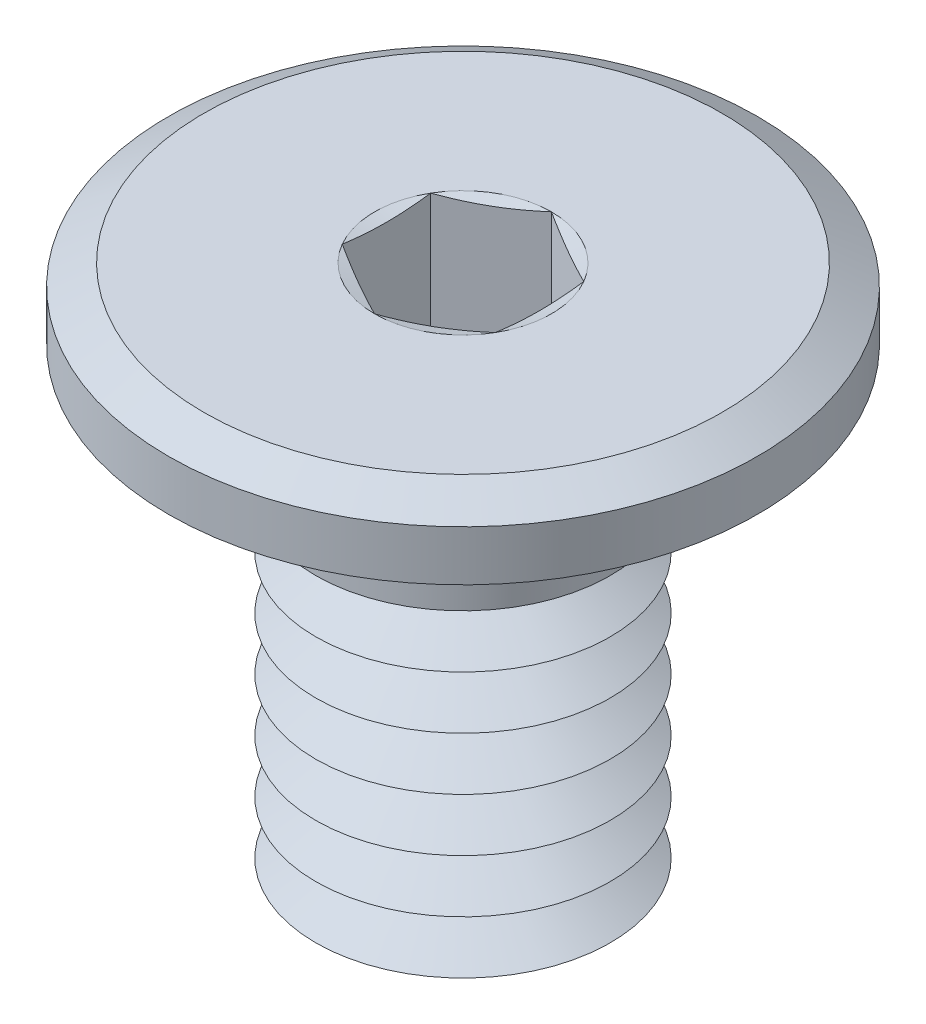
ISO-10303-21;
HEADER;
FILE_DESCRIPTION(('STEP AP214'),'2;1');
FILE_NAME('part.step','',(''),(''),'','','');
FILE_SCHEMA(('AUTOMOTIVE_DESIGN { 1 0 10303 214 1 1 1 1 }'));
ENDSEC;
DATA;
#1=APPLICATION_CONTEXT('core data for automotive mechanical design processes');
#2=APPLICATION_PROTOCOL_DEFINITION('international standard','automotive_design',2000,#1);
#3=PRODUCT_CONTEXT('',#1,'mechanical');
#4=PRODUCT('Part','Part','',(#3));
#5=PRODUCT_RELATED_PRODUCT_CATEGORY('part','',(#4));
#6=PRODUCT_DEFINITION_FORMATION('','',#4);
#7=PRODUCT_DEFINITION_CONTEXT('part definition',#1,'design');
#8=PRODUCT_DEFINITION('design','',#6,#7);
#9=PRODUCT_DEFINITION_SHAPE('','',#8);
#10=(LENGTH_UNIT() NAMED_UNIT(*) SI_UNIT(.MILLI.,.METRE.));
#11=(NAMED_UNIT(*) PLANE_ANGLE_UNIT() SI_UNIT($,.RADIAN.));
#12=(NAMED_UNIT(*) SI_UNIT($,.STERADIAN.) SOLID_ANGLE_UNIT());
#13=UNCERTAINTY_MEASURE_WITH_UNIT(LENGTH_MEASURE(1.E-05),#10,'distance_accuracy_value','');
#14=(GEOMETRIC_REPRESENTATION_CONTEXT(3) GLOBAL_UNCERTAINTY_ASSIGNED_CONTEXT((#13)) GLOBAL_UNIT_ASSIGNED_CONTEXT((#10,
#11,#12)) REPRESENTATION_CONTEXT('',''));
#15=CARTESIAN_POINT('',(0.,0.,0.));
#16=DIRECTION('',(0.,0.,1.));
#17=DIRECTION('',(1.,0.,0.));
#18=AXIS2_PLACEMENT_3D('',#15,#16,#17);
#19=CARTESIAN_POINT('',(0.,-3.925,0.));
#20=DIRECTION('',(0.,-1.,0.));
#21=DIRECTION('',(0.,0.,-1.));
#22=AXIS2_PLACEMENT_3D('',#19,#20,#21);
#23=CONICAL_SURFACE('',#22,1.25,1.0471975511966);
#24=CARTESIAN_POINT('',(0.,-3.7,0.));
#25=DIRECTION('',(0.,1.,0.));
#26=DIRECTION('',(0.,0.,1.));
#27=AXIS2_PLACEMENT_3D('',#24,#25,#26);
#28=CIRCLE('',#27,0.860288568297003);
#29=CARTESIAN_POINT('',(0.,-3.7,0.860288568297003));
#30=VERTEX_POINT('',#29);
#31=EDGE_CURVE('E411',#30,#30,#28,.T.);
#32=ORIENTED_EDGE('',*,*,#31,.F.);
#33=EDGE_LOOP('',(#32));
#34=FACE_BOUND('',#33,.T.);
#35=CARTESIAN_POINT('',(0.,-3.925,0.));
#36=DIRECTION('',(0.,1.,0.));
#37=DIRECTION('',(0.,0.,1.));
#38=AXIS2_PLACEMENT_3D('',#35,#36,#37);
#39=CIRCLE('',#38,1.25);
#40=CARTESIAN_POINT('',(0.,-3.925,1.25));
#41=VERTEX_POINT('',#40);
#42=EDGE_CURVE('E415',#41,#41,#39,.T.);
#43=ORIENTED_EDGE('',*,*,#42,.T.);
#44=EDGE_LOOP('',(#43));
#45=FACE_BOUND('',#44,.T.);
#46=ADVANCED_FACE('F39',(#34,#45),#23,.T.);
#47=CARTESIAN_POINT('',(0.,-3.7,0.));
#48=DIRECTION('',(0.,1.,0.));
#49=DIRECTION('',(0.,0.,1.));
#50=AXIS2_PLACEMENT_3D('',#47,#48,#49);
#51=CONICAL_SURFACE('',#50,0.860288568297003,1.0471975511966);
#52=CARTESIAN_POINT('',(0.,-3.475,0.));
#53=DIRECTION('',(0.,1.,0.));
#54=DIRECTION('',(0.,0.,1.));
#55=AXIS2_PLACEMENT_3D('',#52,#53,#54);
#56=CIRCLE('',#55,1.25);
#57=CARTESIAN_POINT('',(0.,-3.475,1.25));
#58=VERTEX_POINT('',#57);
#59=EDGE_CURVE('E407',#58,#58,#56,.T.);
#60=ORIENTED_EDGE('',*,*,#59,.F.);
#61=EDGE_LOOP('',(#60));
#62=FACE_BOUND('',#61,.T.);
#63=ORIENTED_EDGE('',*,*,#31,.T.);
#64=EDGE_LOOP('',(#63));
#65=FACE_BOUND('',#64,.T.);
#66=ADVANCED_FACE('F233',(#62,#65),#51,.T.);
#67=CARTESIAN_POINT('',(0.,-4.6,0.));
#68=DIRECTION('',(0.,-1.,0.));
#69=DIRECTION('',(0.,0.,-1.));
#70=AXIS2_PLACEMENT_3D('',#67,#68,#69);
#71=PLANE('',#70);
#72=CARTESIAN_POINT('',(0.,-4.6,0.));
#73=DIRECTION('',(0.,1.,0.));
#74=DIRECTION('',(0.,0.,1.));
#75=AXIS2_PLACEMENT_3D('',#72,#73,#74);
#76=CIRCLE('',#75,0.860288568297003);
#77=CARTESIAN_POINT('',(0.,-4.6,0.860288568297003));
#78=VERTEX_POINT('',#77);
#79=EDGE_CURVE('E299',#78,#78,#76,.T.);
#80=ORIENTED_EDGE('',*,*,#79,.F.);
#81=EDGE_LOOP('',(#80));
#82=FACE_BOUND('',#81,.T.);
#83=ADVANCED_FACE('F239',(#82),#71,.T.);
#84=CARTESIAN_POINT('',(0.,-4.6,0.));
#85=DIRECTION('',(0.,1.,0.));
#86=DIRECTION('',(0.,0.,1.));
#87=AXIS2_PLACEMENT_3D('',#84,#85,#86);
#88=CONICAL_SURFACE('',#87,0.860288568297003,1.0471975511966);
#89=CARTESIAN_POINT('',(0.,-4.375,0.));
#90=DIRECTION('',(0.,1.,0.));
#91=DIRECTION('',(0.,0.,1.));
#92=AXIS2_PLACEMENT_3D('',#89,#90,#91);
#93=CIRCLE('',#92,1.25);
#94=CARTESIAN_POINT('',(0.,-4.375,1.25));
#95=VERTEX_POINT('',#94);
#96=EDGE_CURVE('E423',#95,#95,#93,.T.);
#97=ORIENTED_EDGE('',*,*,#96,.F.);
#98=EDGE_LOOP('',(#97));
#99=FACE_BOUND('',#98,.T.);
#100=ORIENTED_EDGE('',*,*,#79,.T.);
#101=EDGE_LOOP('',(#100));
#102=FACE_BOUND('',#101,.T.);
#103=ADVANCED_FACE('F254',(#99,#102),#88,.T.);
#104=CARTESIAN_POINT('',(0.,-4.375,0.));
#105=DIRECTION('',(0.,-1.,0.));
#106=DIRECTION('',(0.,0.,-1.));
#107=AXIS2_PLACEMENT_3D('',#104,#105,#106);
#108=CONICAL_SURFACE('',#107,1.25,1.0471975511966);
#109=CARTESIAN_POINT('',(0.,-4.15,0.));
#110=DIRECTION('',(0.,1.,0.));
#111=DIRECTION('',(0.,0.,1.));
#112=AXIS2_PLACEMENT_3D('',#109,#110,#111);
#113=CIRCLE('',#112,0.860288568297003);
#114=CARTESIAN_POINT('',(0.,-4.15,0.860288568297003));
#115=VERTEX_POINT('',#114);
#116=EDGE_CURVE('E419',#115,#115,#113,.T.);
#117=ORIENTED_EDGE('',*,*,#116,.F.);
#118=EDGE_LOOP('',(#117));
#119=FACE_BOUND('',#118,.T.);
#120=ORIENTED_EDGE('',*,*,#96,.T.);
#121=EDGE_LOOP('',(#120));
#122=FACE_BOUND('',#121,.T.);
#123=ADVANCED_FACE('F250',(#119,#122),#108,.T.);
#124=CARTESIAN_POINT('',(0.,-4.15,0.));
#125=DIRECTION('',(0.,1.,0.));
#126=DIRECTION('',(0.,0.,1.));
#127=AXIS2_PLACEMENT_3D('',#124,#125,#126);
#128=CONICAL_SURFACE('',#127,0.860288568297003,1.0471975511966);
#129=ORIENTED_EDGE('',*,*,#42,.F.);
#130=EDGE_LOOP('',(#129));
#131=FACE_BOUND('',#130,.T.);
#132=ORIENTED_EDGE('',*,*,#116,.T.);
#133=EDGE_LOOP('',(#132));
#134=FACE_BOUND('',#133,.T.);
#135=ADVANCED_FACE('F246',(#131,#134),#128,.T.);
#136=CARTESIAN_POINT('',(0.,-3.475,0.));
#137=DIRECTION('',(0.,-1.,0.));
#138=DIRECTION('',(0.,0.,-1.));
#139=AXIS2_PLACEMENT_3D('',#136,#137,#138);
#140=CONICAL_SURFACE('',#139,1.25,1.0471975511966);
#141=CARTESIAN_POINT('',(0.,-3.25,0.));
#142=DIRECTION('',(0.,1.,0.));
#143=DIRECTION('',(0.,0.,1.));
#144=AXIS2_PLACEMENT_3D('',#141,#142,#143);
#145=CIRCLE('',#144,0.860288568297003);
#146=CARTESIAN_POINT('',(0.,-3.25,0.860288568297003));
#147=VERTEX_POINT('',#146);
#148=EDGE_CURVE('E403',#147,#147,#145,.T.);
#149=ORIENTED_EDGE('',*,*,#148,.F.);
#150=EDGE_LOOP('',(#149));
#151=FACE_BOUND('',#150,.T.);
#152=ORIENTED_EDGE('',*,*,#59,.T.);
#153=EDGE_LOOP('',(#152));
#154=FACE_BOUND('',#153,.T.);
#155=ADVANCED_FACE('F249',(#151,#154),#140,.T.);
#156=CARTESIAN_POINT('',(0.,-3.25,0.));
#157=DIRECTION('',(0.,1.,0.));
#158=DIRECTION('',(0.,0.,1.));
#159=AXIS2_PLACEMENT_3D('',#156,#157,#158);
#160=CONICAL_SURFACE('',#159,0.860288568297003,1.0471975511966);
#161=CARTESIAN_POINT('',(0.,-3.025,0.));
#162=DIRECTION('',(0.,1.,0.));
#163=DIRECTION('',(0.,0.,1.));
#164=AXIS2_PLACEMENT_3D('',#161,#162,#163);
#165=CIRCLE('',#164,1.25);
#166=CARTESIAN_POINT('',(0.,-3.025,1.25));
#167=VERTEX_POINT('',#166);
#168=EDGE_CURVE('E399',#167,#167,#165,.T.);
#169=ORIENTED_EDGE('',*,*,#168,.F.);
#170=EDGE_LOOP('',(#169));
#171=FACE_BOUND('',#170,.T.);
#172=ORIENTED_EDGE('',*,*,#148,.T.);
#173=EDGE_LOOP('',(#172));
#174=FACE_BOUND('',#173,.T.);
#175=ADVANCED_FACE('F506',(#171,#174),#160,.T.);
#176=CARTESIAN_POINT('',(0.,-3.025,0.));
#177=DIRECTION('',(0.,-1.,0.));
#178=DIRECTION('',(0.,0.,-1.));
#179=AXIS2_PLACEMENT_3D('',#176,#177,#178);
#180=CONICAL_SURFACE('',#179,1.25,1.0471975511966);
#181=CARTESIAN_POINT('',(0.,-2.8,0.));
#182=DIRECTION('',(0.,1.,0.));
#183=DIRECTION('',(0.,0.,1.));
#184=AXIS2_PLACEMENT_3D('',#181,#182,#183);
#185=CIRCLE('',#184,0.860288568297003);
#186=CARTESIAN_POINT('',(0.,-2.8,0.860288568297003));
#187=VERTEX_POINT('',#186);
#188=EDGE_CURVE('E395',#187,#187,#185,.T.);
#189=ORIENTED_EDGE('',*,*,#188,.F.);
#190=EDGE_LOOP('',(#189));
#191=FACE_BOUND('',#190,.T.);
#192=ORIENTED_EDGE('',*,*,#168,.T.);
#193=EDGE_LOOP('',(#192));
#194=FACE_BOUND('',#193,.T.);
#195=ADVANCED_FACE('F502',(#191,#194),#180,.T.);
#196=CARTESIAN_POINT('',(0.,-2.8,0.));
#197=DIRECTION('',(0.,1.,0.));
#198=DIRECTION('',(0.,0.,1.));
#199=AXIS2_PLACEMENT_3D('',#196,#197,#198);
#200=CONICAL_SURFACE('',#199,0.860288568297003,1.0471975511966);
#201=CARTESIAN_POINT('',(0.,-2.575,0.));
#202=DIRECTION('',(0.,1.,0.));
#203=DIRECTION('',(0.,0.,1.));
#204=AXIS2_PLACEMENT_3D('',#201,#202,#203);
#205=CIRCLE('',#204,1.25);
#206=CARTESIAN_POINT('',(0.,-2.575,1.25));
#207=VERTEX_POINT('',#206);
#208=EDGE_CURVE('E391',#207,#207,#205,.T.);
#209=ORIENTED_EDGE('',*,*,#208,.F.);
#210=EDGE_LOOP('',(#209));
#211=FACE_BOUND('',#210,.T.);
#212=ORIENTED_EDGE('',*,*,#188,.T.);
#213=EDGE_LOOP('',(#212));
#214=FACE_BOUND('',#213,.T.);
#215=ADVANCED_FACE('F498',(#211,#214),#200,.T.);
#216=CARTESIAN_POINT('',(0.,-2.575,0.));
#217=DIRECTION('',(0.,-1.,0.));
#218=DIRECTION('',(0.,0.,-1.));
#219=AXIS2_PLACEMENT_3D('',#216,#217,#218);
#220=CONICAL_SURFACE('',#219,1.25,1.0471975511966);
#221=CARTESIAN_POINT('',(0.,-2.35,0.));
#222=DIRECTION('',(0.,1.,0.));
#223=DIRECTION('',(0.,0.,1.));
#224=AXIS2_PLACEMENT_3D('',#221,#222,#223);
#225=CIRCLE('',#224,0.860288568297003);
#226=CARTESIAN_POINT('',(0.,-2.35,0.860288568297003));
#227=VERTEX_POINT('',#226);
#228=EDGE_CURVE('E387',#227,#227,#225,.T.);
#229=ORIENTED_EDGE('',*,*,#228,.F.);
#230=EDGE_LOOP('',(#229));
#231=FACE_BOUND('',#230,.T.);
#232=ORIENTED_EDGE('',*,*,#208,.T.);
#233=EDGE_LOOP('',(#232));
#234=FACE_BOUND('',#233,.T.);
#235=ADVANCED_FACE('F494',(#231,#234),#220,.T.);
#236=CARTESIAN_POINT('',(0.,-2.35,0.));
#237=DIRECTION('',(0.,1.,0.));
#238=DIRECTION('',(0.,0.,1.));
#239=AXIS2_PLACEMENT_3D('',#236,#237,#238);
#240=CONICAL_SURFACE('',#239,0.860288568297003,1.0471975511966);
#241=CARTESIAN_POINT('',(0.,-2.125,0.));
#242=DIRECTION('',(0.,1.,0.));
#243=DIRECTION('',(0.,0.,1.));
#244=AXIS2_PLACEMENT_3D('',#241,#242,#243);
#245=CIRCLE('',#244,1.25);
#246=CARTESIAN_POINT('',(0.,-2.125,1.25));
#247=VERTEX_POINT('',#246);
#248=EDGE_CURVE('E383',#247,#247,#245,.T.);
#249=ORIENTED_EDGE('',*,*,#248,.F.);
#250=EDGE_LOOP('',(#249));
#251=FACE_BOUND('',#250,.T.);
#252=ORIENTED_EDGE('',*,*,#228,.T.);
#253=EDGE_LOOP('',(#252));
#254=FACE_BOUND('',#253,.T.);
#255=ADVANCED_FACE('F490',(#251,#254),#240,.T.);
#256=CARTESIAN_POINT('',(0.,-2.125,0.));
#257=DIRECTION('',(0.,-1.,0.));
#258=DIRECTION('',(0.,0.,-1.));
#259=AXIS2_PLACEMENT_3D('',#256,#257,#258);
#260=CONICAL_SURFACE('',#259,1.25,1.0471975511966);
#261=CARTESIAN_POINT('',(0.,-1.9,0.));
#262=DIRECTION('',(0.,1.,0.));
#263=DIRECTION('',(0.,0.,1.));
#264=AXIS2_PLACEMENT_3D('',#261,#262,#263);
#265=CIRCLE('',#264,0.860288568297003);
#266=CARTESIAN_POINT('',(0.,-1.9,0.860288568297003));
#267=VERTEX_POINT('',#266);
#268=EDGE_CURVE('E379',#267,#267,#265,.T.);
#269=ORIENTED_EDGE('',*,*,#268,.F.);
#270=EDGE_LOOP('',(#269));
#271=FACE_BOUND('',#270,.T.);
#272=ORIENTED_EDGE('',*,*,#248,.T.);
#273=EDGE_LOOP('',(#272));
#274=FACE_BOUND('',#273,.T.);
#275=ADVANCED_FACE('F486',(#271,#274),#260,.T.);
#276=CARTESIAN_POINT('',(0.,-1.9,0.));
#277=DIRECTION('',(0.,1.,0.));
#278=DIRECTION('',(0.,0.,1.));
#279=AXIS2_PLACEMENT_3D('',#276,#277,#278);
#280=CONICAL_SURFACE('',#279,0.860288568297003,1.0471975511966);
#281=CARTESIAN_POINT('',(0.,-1.675,0.));
#282=DIRECTION('',(0.,1.,0.));
#283=DIRECTION('',(0.,0.,1.));
#284=AXIS2_PLACEMENT_3D('',#281,#282,#283);
#285=CIRCLE('',#284,1.25);
#286=CARTESIAN_POINT('',(0.,-1.675,1.25));
#287=VERTEX_POINT('',#286);
#288=EDGE_CURVE('E364',#287,#287,#285,.T.);
#289=ORIENTED_EDGE('',*,*,#288,.F.);
#290=EDGE_LOOP('',(#289));
#291=FACE_BOUND('',#290,.T.);
#292=ORIENTED_EDGE('',*,*,#268,.T.);
#293=EDGE_LOOP('',(#292));
#294=FACE_BOUND('',#293,.T.);
#295=ADVANCED_FACE('F274',(#291,#294),#280,.T.);
#296=CARTESIAN_POINT('',(0.,0.,0.));
#297=DIRECTION('',(0.,1.,0.));
#298=DIRECTION('',(0.,0.,1.));
#299=AXIS2_PLACEMENT_3D('',#296,#297,#298);
#300=PLANE('',#299);
#301=CARTESIAN_POINT('',(0.,0.,0.));
#302=DIRECTION('',(0.,1.,0.));
#303=DIRECTION('',(0.,0.,1.));
#304=AXIS2_PLACEMENT_3D('',#301,#302,#303);
#305=CIRCLE('',#304,0.750555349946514);
#306=CARTESIAN_POINT('',(0.,0.,0.750555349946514));
#307=VERTEX_POINT('',#306);
#308=CARTESIAN_POINT('',(0.65,0.,0.375277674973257));
#309=VERTEX_POINT('',#308);
#310=EDGE_CURVE('E66',#307,#309,#305,.T.);
#311=ORIENTED_EDGE('',*,*,#310,.F.);
#312=CARTESIAN_POINT('',(-0.65,0.,0.375277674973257));
#313=VERTEX_POINT('',#312);
#314=EDGE_CURVE('E169',#313,#307,#305,.T.);
#315=ORIENTED_EDGE('',*,*,#314,.F.);
#316=CARTESIAN_POINT('',(-0.65,0.,-0.375277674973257));
#317=VERTEX_POINT('',#316);
#318=EDGE_CURVE('E164',#317,#313,#305,.T.);
#319=ORIENTED_EDGE('',*,*,#318,.F.);
#320=CARTESIAN_POINT('',(0.,0.,-0.750555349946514));
#321=VERTEX_POINT('',#320);
#322=EDGE_CURVE('E128',#321,#317,#305,.T.);
#323=ORIENTED_EDGE('',*,*,#322,.F.);
#324=CARTESIAN_POINT('',(0.65,0.,-0.375277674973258));
#325=VERTEX_POINT('',#324);
#326=EDGE_CURVE('E119',#325,#321,#305,.T.);
#327=ORIENTED_EDGE('',*,*,#326,.F.);
#328=EDGE_CURVE('E59',#309,#325,#305,.T.);
#329=ORIENTED_EDGE('',*,*,#328,.F.);
#330=EDGE_LOOP('',(#311,#315,#319,#323,#327,#329));
#331=FACE_BOUND('',#330,.T.);
#332=CARTESIAN_POINT('',(0.,0.,0.));
#333=DIRECTION('',(0.,1.,0.));
#334=DIRECTION('',(0.,0.,1.));
#335=AXIS2_PLACEMENT_3D('',#332,#333,#334);
#336=CIRCLE('',#335,2.2);
#337=CARTESIAN_POINT('',(0.,0.,2.2));
#338=VERTEX_POINT('',#337);
#339=EDGE_CURVE('E295',#338,#338,#336,.T.);
#340=ORIENTED_EDGE('',*,*,#339,.T.);
#341=EDGE_LOOP('',(#340));
#342=FACE_BOUND('',#341,.T.);
#343=ADVANCED_FACE('F160',(#331,#342),#300,.T.);
#344=CARTESIAN_POINT('',(0.,-0.6,0.));
#345=DIRECTION('',(0.,1.,0.));
#346=DIRECTION('',(0.,0.,1.));
#347=AXIS2_PLACEMENT_3D('',#344,#345,#346);
#348=CYLINDRICAL_SURFACE('',#347,2.5);
#349=CARTESIAN_POINT('',(0.,-0.173205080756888,0.));
#350=DIRECTION('',(0.,1.,0.));
#351=DIRECTION('',(0.,0.,1.));
#352=AXIS2_PLACEMENT_3D('',#349,#350,#351);
#353=CIRCLE('',#352,2.5);
#354=CARTESIAN_POINT('',(0.,-0.173205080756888,2.5));
#355=VERTEX_POINT('',#354);
#356=EDGE_CURVE('E306',#355,#355,#353,.F.);
#357=ORIENTED_EDGE('',*,*,#356,.T.);
#358=EDGE_LOOP('',(#357));
#359=FACE_BOUND('',#358,.T.);
#360=CARTESIAN_POINT('',(0.,-0.6,0.));
#361=DIRECTION('',(0.,1.,0.));
#362=DIRECTION('',(0.,0.,1.));
#363=AXIS2_PLACEMENT_3D('',#360,#361,#362);
#364=CIRCLE('',#363,2.5);
#365=CARTESIAN_POINT('',(0.,-0.6,2.5));
#366=VERTEX_POINT('',#365);
#367=EDGE_CURVE('E291',#366,#366,#364,.T.);
#368=ORIENTED_EDGE('',*,*,#367,.T.);
#369=EDGE_LOOP('',(#368));
#370=FACE_BOUND('',#369,.T.);
#371=ADVANCED_FACE('F270',(#359,#370),#348,.T.);
#372=CARTESIAN_POINT('',(0.,-0.6,0.));
#373=DIRECTION('',(0.,1.,0.));
#374=DIRECTION('',(0.,0.,1.));
#375=AXIS2_PLACEMENT_3D('',#372,#373,#374);
#376=PLANE('',#375);
#377=CARTESIAN_POINT('',(0.,-0.6,0.));
#378=DIRECTION('',(0.,1.,0.));
#379=DIRECTION('',(0.,0.,1.));
#380=AXIS2_PLACEMENT_3D('',#377,#378,#379);
#381=CIRCLE('',#380,1.35);
#382=CARTESIAN_POINT('',(0.,-0.6,1.35));
#383=VERTEX_POINT('',#382);
#384=EDGE_CURVE('E286',#383,#383,#381,.T.);
#385=ORIENTED_EDGE('',*,*,#384,.T.);
#386=EDGE_LOOP('',(#385));
#387=FACE_BOUND('',#386,.T.);
#388=ORIENTED_EDGE('',*,*,#367,.F.);
#389=EDGE_LOOP('',(#388));
#390=FACE_BOUND('',#389,.T.);
#391=ADVANCED_FACE('F266',(#387,#390),#376,.F.);
#392=CARTESIAN_POINT('',(0.,-4.6,0.));
#393=DIRECTION('',(0.,1.,0.));
#394=DIRECTION('',(0.,0.,1.));
#395=AXIS2_PLACEMENT_3D('',#392,#393,#394);
#396=CYLINDRICAL_SURFACE('',#395,1.25);
#397=CARTESIAN_POINT('',(0.,-0.7,0.));
#398=DIRECTION('',(0.,1.,0.));
#399=DIRECTION('',(0.,0.,1.));
#400=AXIS2_PLACEMENT_3D('',#397,#398,#399);
#401=CIRCLE('',#400,1.25);
#402=CARTESIAN_POINT('',(0.,-0.7,1.25));
#403=VERTEX_POINT('',#402);
#404=EDGE_CURVE('E289',#403,#403,#401,.F.);
#405=ORIENTED_EDGE('',*,*,#404,.T.);
#406=EDGE_LOOP('',(#405));
#407=FACE_BOUND('',#406,.T.);
#408=ORIENTED_EDGE('',*,*,#288,.T.);
#409=EDGE_LOOP('',(#408));
#410=FACE_BOUND('',#409,.T.);
#411=ADVANCED_FACE('F262',(#407,#410),#396,.T.);
#412=CARTESIAN_POINT('',(0.,-0.7,0.));
#413=DIRECTION('',(0.,1.,0.));
#414=DIRECTION('',(0.,0.,1.));
#415=AXIS2_PLACEMENT_3D('',#412,#413,#414);
#416=TOROIDAL_SURFACE('',#415,1.35,0.1);
#417=ORIENTED_EDGE('',*,*,#384,.F.);
#418=EDGE_LOOP('',(#417));
#419=FACE_BOUND('',#418,.T.);
#420=ORIENTED_EDGE('',*,*,#404,.F.);
#421=EDGE_LOOP('',(#420));
#422=FACE_BOUND('',#421,.T.);
#423=ADVANCED_FACE('F265',(#419,#422),#416,.F.);
#424=CARTESIAN_POINT('',(0.,0.,0.));
#425=DIRECTION('',(0.,-1.,0.));
#426=DIRECTION('',(0.,0.,-1.));
#427=AXIS2_PLACEMENT_3D('',#424,#425,#426);
#428=CONICAL_SURFACE('',#427,2.2,1.0471975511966);
#429=ORIENTED_EDGE('',*,*,#356,.F.);
#430=EDGE_LOOP('',(#429));
#431=FACE_BOUND('',#430,.T.);
#432=ORIENTED_EDGE('',*,*,#339,.F.);
#433=EDGE_LOOP('',(#432));
#434=FACE_BOUND('',#433,.T.);
#435=ADVANCED_FACE('F41',(#431,#434),#428,.T.);
#436=CARTESIAN_POINT('',(0.,0.,0.));
#437=DIRECTION('',(0.,1.,0.));
#438=DIRECTION('',(0.,0.,1.));
#439=AXIS2_PLACEMENT_3D('',#436,#437,#438);
#440=CONICAL_SURFACE('',#439,0.750555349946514,1.30899693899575);
#441=ORIENTED_EDGE('',*,*,#322,.T.);
#442=CARTESIAN_POINT('',(0.000200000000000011,3.09472466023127E-05,-0.750670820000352));
#443=CARTESIAN_POINT('',(-0.0268094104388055,-0.00415092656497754,-0.735076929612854));
#444=CARTESIAN_POINT('',(-0.0538678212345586,-0.00794750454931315,-0.719454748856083));
#445=CARTESIAN_POINT('',(-0.108080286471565,-0.0146178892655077,-0.688155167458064));
#446=CARTESIAN_POINT('',(-0.135234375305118,-0.0174913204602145,-0.672477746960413));
#447=CARTESIAN_POINT('',(-0.18947340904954,-0.0221475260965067,-0.641162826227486));
#448=CARTESIAN_POINT('',(-0.216557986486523,-0.0239358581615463,-0.625525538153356));
#449=CARTESIAN_POINT('',(-0.270761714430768,-0.0263338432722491,-0.594231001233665));
#450=CARTESIAN_POINT('',(-0.297880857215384,-0.0269437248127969,-0.578573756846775));
#451=CARTESIAN_POINT('',(-0.352119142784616,-0.0269437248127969,-0.547259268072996));
#452=CARTESIAN_POINT('',(-0.379238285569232,-0.0263338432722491,-0.531602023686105));
#453=CARTESIAN_POINT('',(-0.433442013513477,-0.0239358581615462,-0.500307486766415));
#454=CARTESIAN_POINT('',(-0.460526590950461,-0.0221475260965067,-0.484670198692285));
#455=CARTESIAN_POINT('',(-0.514765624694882,-0.0174913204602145,-0.453355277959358));
#456=CARTESIAN_POINT('',(-0.541919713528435,-0.0146178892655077,-0.437677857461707));
#457=CARTESIAN_POINT('',(-0.596132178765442,-0.00794750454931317,-0.406378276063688));
#458=CARTESIAN_POINT('',(-0.623190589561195,-0.00415092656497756,-0.390756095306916));
#459=CARTESIAN_POINT('',(-0.6502,3.09472466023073E-05,-0.375162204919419));
#460=B_SPLINE_CURVE_WITH_KNOTS('',3,(#442,#443,#444,#445,#446,#447,#448,#449,#450,#451,#452,
#453,#454,#455,#456,#457,#458,#459),.UNSPECIFIED.,.F.,.F.,(4,2,2,2,2,2,2,2,4),(0.,
0.0944056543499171,0.188849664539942,0.282805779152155,0.376743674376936,0.470681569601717,
0.564637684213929,0.659081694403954,0.753487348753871),.UNSPECIFIED.);
#461=EDGE_CURVE('E11',#321,#317,#460,.T.);
#462=ORIENTED_EDGE('',*,*,#461,.F.);
#463=EDGE_LOOP('',(#441,#462));
#464=FACE_BOUND('',#463,.T.);
#465=ADVANCED_FACE('F132',(#464),#440,.F.);
#466=ORIENTED_EDGE('',*,*,#318,.T.);
#467=CARTESIAN_POINT('',(-0.65,0.153431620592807,-1.15250975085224));
#468=CARTESIAN_POINT('',(-0.65,0.140485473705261,-1.09696292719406));
#469=CARTESIAN_POINT('',(-0.65,0.12772104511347,-1.04137089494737));
#470=CARTESIAN_POINT('',(-0.65,0.102806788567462,-0.93003898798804));
#471=CARTESIAN_POINT('',(-0.65,0.0906570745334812,-0.874299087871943));
#472=CARTESIAN_POINT('',(-0.65,0.0671143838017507,-0.762091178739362));
#473=CARTESIAN_POINT('',(-0.65,0.0557299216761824,-0.70562136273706));
#474=CARTESIAN_POINT('',(-0.65,0.0342960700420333,-0.59241870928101));
#475=CARTESIAN_POINT('',(-0.65,0.0242468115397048,-0.535685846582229));
#476=CARTESIAN_POINT('',(-0.65,0.00641278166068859,-0.423455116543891));
#477=CARTESIAN_POINT('',(-0.65,-0.00142665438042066,-0.367966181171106));
#478=CARTESIAN_POINT('',(-0.65,-0.0143371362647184,-0.256669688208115));
#479=CARTESIAN_POINT('',(-0.65,-0.0194090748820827,-0.200862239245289));
#480=CARTESIAN_POINT('',(-0.65,-0.025908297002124,-0.0892782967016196));
#481=CARTESIAN_POINT('',(-0.65,-0.0273521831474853,-0.0335028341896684));
#482=CARTESIAN_POINT('',(-0.65,-0.0263311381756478,0.078014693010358));
#483=CARTESIAN_POINT('',(-0.65,-0.0238659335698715,0.133756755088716));
#484=CARTESIAN_POINT('',(-0.65,-0.016691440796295,0.229596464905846));
#485=CARTESIAN_POINT('',(-0.65,-0.0127907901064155,0.269759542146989));
#486=CARTESIAN_POINT('',(-0.65,-0.00354681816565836,0.349915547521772));
#487=CARTESIAN_POINT('',(-0.65,0.00179646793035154,0.389908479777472));
#488=CARTESIAN_POINT('',(-0.65,0.0195190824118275,0.50990254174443));
#489=CARTESIAN_POINT('',(-0.65,0.0335668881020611,0.589653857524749));
#490=CARTESIAN_POINT('',(-0.65,0.0566589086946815,0.709742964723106));
#491=CARTESIAN_POINT('',(-0.65,0.0647873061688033,0.750268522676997));
#492=CARTESIAN_POINT('',(-0.65,0.0815416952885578,0.831218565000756));
#493=CARTESIAN_POINT('',(-0.65,0.0901676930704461,0.871643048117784));
#494=CARTESIAN_POINT('',(-0.65,0.107740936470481,0.952178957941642));
#495=CARTESIAN_POINT('',(-0.65,0.116686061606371,0.992290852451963));
#496=CARTESIAN_POINT('',(-0.65,0.134863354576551,1.07244661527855));
#497=CARTESIAN_POINT('',(-0.65,0.144095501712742,1.11249048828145));
#498=CARTESIAN_POINT('',(-0.65,0.153431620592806,1.15250975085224));
#499=B_SPLINE_CURVE_WITH_KNOTS('',3,(#467,#468,#469,#470,#471,#472,#473,#474,#475,#476,#477,
#478,#479,#480,#481,#482,#483,#484,#485,#486,#487,#488,#489,#490,#491,#492,#493,#494,#495,#496,
#497,#498),.UNSPECIFIED.,.F.,.F.,(4,2,2,2,2,2,2,2,2,2,2,2,2,2,2,4),(0.,0.171110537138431,
0.342252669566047,0.515060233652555,0.687884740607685,0.855957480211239,1.02397596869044,
1.19122416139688,1.3584840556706,1.4795115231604,1.60053604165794,1.84338230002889,
1.9673809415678,2.09138111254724,2.21467179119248,2.33795359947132),.UNSPECIFIED.);
#500=EDGE_CURVE('E172',#317,#313,#499,.T.);
#501=ORIENTED_EDGE('',*,*,#500,.F.);
#502=EDGE_LOOP('',(#466,#501));
#503=FACE_BOUND('',#502,.T.);
#504=ADVANCED_FACE('F570',(#503),#440,.F.);
#505=ORIENTED_EDGE('',*,*,#314,.T.);
#506=CARTESIAN_POINT('',(-0.6502,3.09472466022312E-05,0.375162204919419));
#507=CARTESIAN_POINT('',(-0.623190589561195,-0.0041509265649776,0.390756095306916));
#508=CARTESIAN_POINT('',(-0.596132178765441,-0.00794750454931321,0.406378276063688));
#509=CARTESIAN_POINT('',(-0.541919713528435,-0.0146178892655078,0.437677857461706));
#510=CARTESIAN_POINT('',(-0.514765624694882,-0.0174913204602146,0.453355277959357));
#511=CARTESIAN_POINT('',(-0.460526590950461,-0.0221475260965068,0.484670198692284));
#512=CARTESIAN_POINT('',(-0.433442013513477,-0.0239358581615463,0.500307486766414));
#513=CARTESIAN_POINT('',(-0.379238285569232,-0.0263338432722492,0.531602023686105));
#514=CARTESIAN_POINT('',(-0.352119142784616,-0.026943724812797,0.547259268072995));
#515=CARTESIAN_POINT('',(-0.297880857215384,-0.026943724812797,0.578573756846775));
#516=CARTESIAN_POINT('',(-0.270761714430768,-0.0263338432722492,0.594231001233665));
#517=CARTESIAN_POINT('',(-0.216557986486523,-0.0239358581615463,0.625525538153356));
#518=CARTESIAN_POINT('',(-0.18947340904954,-0.0221475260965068,0.641162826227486));
#519=CARTESIAN_POINT('',(-0.135234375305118,-0.0174913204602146,0.672477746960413));
#520=CARTESIAN_POINT('',(-0.108080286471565,-0.0146178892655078,0.688155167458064));
#521=CARTESIAN_POINT('',(-0.0538678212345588,-0.00794750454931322,0.719454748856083));
#522=CARTESIAN_POINT('',(-0.0268094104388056,-0.0041509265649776,0.735076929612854));
#523=CARTESIAN_POINT('',(0.000199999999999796,3.09472466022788E-05,0.750670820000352));
#524=B_SPLINE_CURVE_WITH_KNOTS('',3,(#506,#507,#508,#509,#510,#511,#512,#513,#514,#515,#516,
#517,#518,#519,#520,#521,#522,#523),.UNSPECIFIED.,.F.,.F.,(4,2,2,2,2,2,2,2,4),(0.,
0.0944056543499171,0.188849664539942,0.282805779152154,0.376743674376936,0.470681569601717,
0.564637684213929,0.659081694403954,0.753487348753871),.UNSPECIFIED.);
#525=EDGE_CURVE('E180',#313,#307,#524,.T.);
#526=ORIENTED_EDGE('',*,*,#525,.F.);
#527=EDGE_LOOP('',(#505,#526));
#528=FACE_BOUND('',#527,.T.);
#529=ADVANCED_FACE('F450',(#528),#440,.F.);
#530=ORIENTED_EDGE('',*,*,#310,.T.);
#531=CARTESIAN_POINT('',(-0.000200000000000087,3.09472466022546E-05,0.750670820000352));
#532=CARTESIAN_POINT('',(0.0268094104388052,-0.00415092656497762,0.735076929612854));
#533=CARTESIAN_POINT('',(0.0538678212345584,-0.00794750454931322,0.719454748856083));
#534=CARTESIAN_POINT('',(0.108080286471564,-0.0146178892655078,0.688155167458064));
#535=CARTESIAN_POINT('',(0.135234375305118,-0.0174913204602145,0.672477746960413));
#536=CARTESIAN_POINT('',(0.189473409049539,-0.0221475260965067,0.641162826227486));
#537=CARTESIAN_POINT('',(0.216557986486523,-0.0239358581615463,0.625525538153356));
#538=CARTESIAN_POINT('',(0.270761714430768,-0.0263338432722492,0.594231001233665));
#539=CARTESIAN_POINT('',(0.297880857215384,-0.0269437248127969,0.578573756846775));
#540=CARTESIAN_POINT('',(0.352119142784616,-0.0269437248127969,0.547259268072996));
#541=CARTESIAN_POINT('',(0.379238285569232,-0.0263338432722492,0.531602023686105));
#542=CARTESIAN_POINT('',(0.433442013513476,-0.0239358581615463,0.500307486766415));
#543=CARTESIAN_POINT('',(0.46052659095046,-0.0221475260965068,0.484670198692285));
#544=CARTESIAN_POINT('',(0.514765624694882,-0.0174913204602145,0.453355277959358));
#545=CARTESIAN_POINT('',(0.541919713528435,-0.0146178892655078,0.437677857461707));
#546=CARTESIAN_POINT('',(0.596132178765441,-0.00794750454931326,0.406378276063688));
#547=CARTESIAN_POINT('',(0.623190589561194,-0.00415092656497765,0.390756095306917));
#548=CARTESIAN_POINT('',(0.6502,3.09472466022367E-05,0.375162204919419));
#549=B_SPLINE_CURVE_WITH_KNOTS('',3,(#531,#532,#533,#534,#535,#536,#537,#538,#539,#540,#541,
#542,#543,#544,#545,#546,#547,#548),.UNSPECIFIED.,.F.,.F.,(4,2,2,2,2,2,2,2,4),(0.,
0.0944056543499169,0.188849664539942,0.282805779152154,0.376743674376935,0.470681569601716,
0.564637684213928,0.659081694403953,0.753487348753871),.UNSPECIFIED.);
#550=EDGE_CURVE('E199',#307,#309,#549,.T.);
#551=ORIENTED_EDGE('',*,*,#550,.F.);
#552=EDGE_LOOP('',(#530,#551));
#553=FACE_BOUND('',#552,.T.);
#554=ADVANCED_FACE('F452',(#553),#440,.F.);
#555=ORIENTED_EDGE('',*,*,#328,.T.);
#556=CARTESIAN_POINT('',(0.65,0.153431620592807,1.15250975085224));
#557=CARTESIAN_POINT('',(0.65,0.140485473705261,1.09696292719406));
#558=CARTESIAN_POINT('',(0.65,0.12772104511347,1.04137089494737));
#559=CARTESIAN_POINT('',(0.65,0.102806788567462,0.93003898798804));
#560=CARTESIAN_POINT('',(0.65,0.0906570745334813,0.874299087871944));
#561=CARTESIAN_POINT('',(0.65,0.0671143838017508,0.762091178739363));
#562=CARTESIAN_POINT('',(0.65,0.0557299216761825,0.705621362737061));
#563=CARTESIAN_POINT('',(0.65,0.0342960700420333,0.592418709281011));
#564=CARTESIAN_POINT('',(0.65,0.0242468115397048,0.53568584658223));
#565=CARTESIAN_POINT('',(0.65,0.00641278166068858,0.423455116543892));
#566=CARTESIAN_POINT('',(0.65,-0.00142665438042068,0.367966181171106));
#567=CARTESIAN_POINT('',(0.65,-0.0143371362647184,0.256669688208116));
#568=CARTESIAN_POINT('',(0.65,-0.0194090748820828,0.200862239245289));
#569=CARTESIAN_POINT('',(0.65,-0.0259082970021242,0.08927829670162));
#570=CARTESIAN_POINT('',(0.65,-0.0273521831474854,0.0335028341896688));
#571=CARTESIAN_POINT('',(0.65,-0.0263311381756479,-0.0780146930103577));
#572=CARTESIAN_POINT('',(0.65,-0.0238659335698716,-0.133756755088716));
#573=CARTESIAN_POINT('',(0.65,-0.0166914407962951,-0.229596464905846));
#574=CARTESIAN_POINT('',(0.65,-0.0127907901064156,-0.269759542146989));
#575=CARTESIAN_POINT('',(0.65,-0.00354681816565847,-0.349915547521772));
#576=CARTESIAN_POINT('',(0.65,0.00179646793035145,-0.389908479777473));
#577=CARTESIAN_POINT('',(0.65,0.0195190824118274,-0.509902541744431));
#578=CARTESIAN_POINT('',(0.649999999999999,0.033566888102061,-0.589653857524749));
#579=CARTESIAN_POINT('',(0.649999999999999,0.0566589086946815,-0.709742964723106));
#580=CARTESIAN_POINT('',(0.649999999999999,0.0647873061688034,-0.750268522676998));
#581=CARTESIAN_POINT('',(0.649999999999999,0.081541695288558,-0.831218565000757));
#582=CARTESIAN_POINT('',(0.649999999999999,0.0901676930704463,-0.871643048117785));
#583=CARTESIAN_POINT('',(0.649999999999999,0.107740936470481,-0.952178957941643));
#584=CARTESIAN_POINT('',(0.649999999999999,0.116686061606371,-0.992290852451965));
#585=CARTESIAN_POINT('',(0.649999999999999,0.134863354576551,-1.07244661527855));
#586=CARTESIAN_POINT('',(0.649999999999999,0.144095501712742,-1.11249048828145));
#587=CARTESIAN_POINT('',(0.649999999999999,0.153431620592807,-1.15250975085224));
#588=B_SPLINE_CURVE_WITH_KNOTS('',3,(#556,#557,#558,#559,#560,#561,#562,#563,#564,#565,#566,
#567,#568,#569,#570,#571,#572,#573,#574,#575,#576,#577,#578,#579,#580,#581,#582,#583,#584,#585,
#586,#587),.UNSPECIFIED.,.F.,.F.,(4,2,2,2,2,2,2,2,2,2,2,2,2,2,2,4),(0.,0.171110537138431,
0.342252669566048,0.515060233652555,0.687884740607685,0.855957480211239,1.02397596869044,
1.19122416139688,1.3584840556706,1.47951152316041,1.60053604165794,1.84338230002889,
1.9673809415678,2.09138111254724,2.21467179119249,2.33795359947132),.UNSPECIFIED.);
#589=EDGE_CURVE('E149',#309,#325,#588,.T.);
#590=ORIENTED_EDGE('',*,*,#589,.F.);
#591=EDGE_LOOP('',(#555,#590));
#592=FACE_BOUND('',#591,.T.);
#593=ADVANCED_FACE('F192',(#592),#440,.F.);
#594=ORIENTED_EDGE('',*,*,#326,.T.);
#595=CARTESIAN_POINT('',(0.6502,3.09472466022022E-05,-0.375162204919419));
#596=CARTESIAN_POINT('',(0.623190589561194,-0.00415092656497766,-0.390756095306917));
#597=CARTESIAN_POINT('',(0.596132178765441,-0.00794750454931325,-0.406378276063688));
#598=CARTESIAN_POINT('',(0.541919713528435,-0.0146178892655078,-0.437677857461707));
#599=CARTESIAN_POINT('',(0.514765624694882,-0.0174913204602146,-0.453355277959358));
#600=CARTESIAN_POINT('',(0.46052659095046,-0.0221475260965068,-0.484670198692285));
#601=CARTESIAN_POINT('',(0.433442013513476,-0.0239358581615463,-0.500307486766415));
#602=CARTESIAN_POINT('',(0.379238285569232,-0.0263338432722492,-0.531602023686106));
#603=CARTESIAN_POINT('',(0.352119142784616,-0.0269437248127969,-0.547259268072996));
#604=CARTESIAN_POINT('',(0.297880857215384,-0.0269437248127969,-0.578573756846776));
#605=CARTESIAN_POINT('',(0.270761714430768,-0.0263338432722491,-0.594231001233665));
#606=CARTESIAN_POINT('',(0.216557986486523,-0.0239358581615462,-0.625525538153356));
#607=CARTESIAN_POINT('',(0.189473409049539,-0.0221475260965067,-0.641162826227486));
#608=CARTESIAN_POINT('',(0.135234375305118,-0.0174913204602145,-0.672477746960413));
#609=CARTESIAN_POINT('',(0.108080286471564,-0.0146178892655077,-0.688155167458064));
#610=CARTESIAN_POINT('',(0.0538678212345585,-0.00794750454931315,-0.719454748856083));
#611=CARTESIAN_POINT('',(0.0268094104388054,-0.00415092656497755,-0.735076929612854));
#612=CARTESIAN_POINT('',(-0.000200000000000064,3.09472466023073E-05,-0.750670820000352));
#613=B_SPLINE_CURVE_WITH_KNOTS('',3,(#595,#596,#597,#598,#599,#600,#601,#602,#603,#604,#605,
#606,#607,#608,#609,#610,#611,#612),.UNSPECIFIED.,.F.,.F.,(4,2,2,2,2,2,2,2,4),(0.,
0.0944056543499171,0.188849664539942,0.282805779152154,0.376743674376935,0.470681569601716,
0.564637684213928,0.659081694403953,0.75348734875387),.UNSPECIFIED.);
#614=EDGE_CURVE('E123',#325,#321,#613,.T.);
#615=ORIENTED_EDGE('',*,*,#614,.F.);
#616=EDGE_LOOP('',(#594,#615));
#617=FACE_BOUND('',#616,.T.);
#618=ADVANCED_FACE('F121',(#617),#440,.F.);
#619=CARTESIAN_POINT('',(0.,-1.2,0.));
#620=DIRECTION('',(0.,1.,0.));
#621=DIRECTION('',(0.,0.,1.));
#622=AXIS2_PLACEMENT_3D('',#619,#620,#621);
#623=CONICAL_SURFACE('',#622,0.65,1.0471975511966);
#624=CARTESIAN_POINT('',(0.,-1.57527767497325,0.));
#625=VERTEX_POINT('',#624);
#626=VERTEX_LOOP('',#625);
#627=FACE_BOUND('',#626,.T.);
#628=CARTESIAN_POINT('',(0.,-1.2,0.));
#629=DIRECTION('',(0.,1.,0.));
#630=DIRECTION('',(0.,0.,1.));
#631=AXIS2_PLACEMENT_3D('',#628,#629,#630);
#632=CIRCLE('',#631,0.65);
#633=CARTESIAN_POINT('',(0.325,-1.2,0.562916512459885));
#634=VERTEX_POINT('',#633);
#635=CARTESIAN_POINT('',(0.65,-1.2,0.));
#636=VERTEX_POINT('',#635);
#637=EDGE_CURVE('E148',#634,#636,#632,.T.);
#638=ORIENTED_EDGE('',*,*,#637,.T.);
#639=CARTESIAN_POINT('',(0.,-1.2,0.));
#640=DIRECTION('',(0.,1.,0.));
#641=DIRECTION('',(0.,0.,1.));
#642=AXIS2_PLACEMENT_3D('',#639,#640,#641);
#643=CIRCLE('',#642,0.65);
#644=CARTESIAN_POINT('',(0.325,-1.2,-0.562916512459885));
#645=VERTEX_POINT('',#644);
#646=EDGE_CURVE('E53',#636,#645,#643,.T.);
#647=ORIENTED_EDGE('',*,*,#646,.T.);
#648=CARTESIAN_POINT('',(-0.325,-1.2,-0.562916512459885));
#649=VERTEX_POINT('',#648);
#650=EDGE_CURVE('E318',#645,#649,#643,.T.);
#651=ORIENTED_EDGE('',*,*,#650,.T.);
#652=CARTESIAN_POINT('',(-0.65,-1.2,0.));
#653=VERTEX_POINT('',#652);
#654=EDGE_CURVE('E316',#649,#653,#643,.T.);
#655=ORIENTED_EDGE('',*,*,#654,.T.);
#656=CARTESIAN_POINT('',(-0.325,-1.2,0.562916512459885));
#657=VERTEX_POINT('',#656);
#658=EDGE_CURVE('E311',#653,#657,#643,.T.);
#659=ORIENTED_EDGE('',*,*,#658,.T.);
#660=EDGE_CURVE('E309',#657,#634,#643,.T.);
#661=ORIENTED_EDGE('',*,*,#660,.T.);
#662=EDGE_LOOP('',(#638,#647,#651,#655,#659,#661));
#663=FACE_BOUND('',#662,.T.);
#664=ADVANCED_FACE('F191',(#627,#663),#623,.F.);
#665=CARTESIAN_POINT('',(0.,-1.2,0.));
#666=DIRECTION('',(0.,1.,0.));
#667=DIRECTION('',(0.,0.,1.));
#668=AXIS2_PLACEMENT_3D('',#665,#666,#667);
#669=PLANE('',#668);
#670=ORIENTED_EDGE('',*,*,#646,.F.);
#671=DIRECTION('',(0.,0.,-1.));
#672=VECTOR('',#671,1.);
#673=CARTESIAN_POINT('',(0.65,-1.2,0.375277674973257));
#674=LINE('',#673,#672);
#675=CARTESIAN_POINT('',(0.65,-1.2,-0.375277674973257));
#676=VERTEX_POINT('',#675);
#677=EDGE_CURVE('E359',#636,#676,#674,.T.);
#678=ORIENTED_EDGE('',*,*,#677,.T.);
#679=DIRECTION('',(-0.866025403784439,0.,-0.5));
#680=VECTOR('',#679,1.);
#681=CARTESIAN_POINT('',(0.65,-1.2,-0.375277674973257));
#682=LINE('',#681,#680);
#683=EDGE_CURVE('E431',#676,#645,#682,.T.);
#684=ORIENTED_EDGE('',*,*,#683,.T.);
#685=EDGE_LOOP('',(#670,#678,#684));
#686=FACE_BOUND('',#685,.T.);
#687=ADVANCED_FACE('F439',(#686),#669,.T.);
#688=ORIENTED_EDGE('',*,*,#637,.F.);
#689=DIRECTION('',(0.866025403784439,0.,-0.5));
#690=VECTOR('',#689,1.);
#691=CARTESIAN_POINT('',(0.,-1.2,0.750555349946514));
#692=LINE('',#691,#690);
#693=CARTESIAN_POINT('',(0.65,-1.2,0.375277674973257));
#694=VERTEX_POINT('',#693);
#695=EDGE_CURVE('E354',#634,#694,#692,.T.);
#696=ORIENTED_EDGE('',*,*,#695,.T.);
#697=EDGE_CURVE('E157',#694,#636,#674,.T.);
#698=ORIENTED_EDGE('',*,*,#697,.T.);
#699=EDGE_LOOP('',(#688,#696,#698));
#700=FACE_BOUND('',#699,.T.);
#701=ADVANCED_FACE('F441',(#700),#669,.T.);
#702=ORIENTED_EDGE('',*,*,#660,.F.);
#703=DIRECTION('',(0.866025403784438,0.,0.5));
#704=VECTOR('',#703,1.);
#705=CARTESIAN_POINT('',(-0.65,-1.2,0.375277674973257));
#706=LINE('',#705,#704);
#707=CARTESIAN_POINT('',(0.,-1.2,0.750555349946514));
#708=VERTEX_POINT('',#707);
#709=EDGE_CURVE('E346',#657,#708,#706,.T.);
#710=ORIENTED_EDGE('',*,*,#709,.T.);
#711=EDGE_CURVE('E355',#708,#634,#692,.T.);
#712=ORIENTED_EDGE('',*,*,#711,.T.);
#713=EDGE_LOOP('',(#702,#710,#712));
#714=FACE_BOUND('',#713,.T.);
#715=ADVANCED_FACE('F220',(#714),#669,.T.);
#716=ORIENTED_EDGE('',*,*,#658,.F.);
#717=DIRECTION('',(0.,0.,1.));
#718=VECTOR('',#717,1.);
#719=CARTESIAN_POINT('',(-0.65,-1.2,-0.375277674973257));
#720=LINE('',#719,#718);
#721=CARTESIAN_POINT('',(-0.65,-1.2,0.375277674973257));
#722=VERTEX_POINT('',#721);
#723=EDGE_CURVE('E334',#653,#722,#720,.T.);
#724=ORIENTED_EDGE('',*,*,#723,.T.);
#725=EDGE_CURVE('E337',#722,#657,#706,.T.);
#726=ORIENTED_EDGE('',*,*,#725,.T.);
#727=EDGE_LOOP('',(#716,#724,#726));
#728=FACE_BOUND('',#727,.T.);
#729=ADVANCED_FACE('F333',(#728),#669,.T.);
#730=ORIENTED_EDGE('',*,*,#650,.F.);
#731=CARTESIAN_POINT('',(0.,-1.2,-0.750555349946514));
#732=VERTEX_POINT('',#731);
#733=EDGE_CURVE('E433',#645,#732,#682,.T.);
#734=ORIENTED_EDGE('',*,*,#733,.T.);
#735=DIRECTION('',(-0.866025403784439,0.,0.5));
#736=VECTOR('',#735,1.);
#737=CARTESIAN_POINT('',(0.,-1.2,-0.750555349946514));
#738=LINE('',#737,#736);
#739=EDGE_CURVE('E154',#732,#649,#738,.T.);
#740=ORIENTED_EDGE('',*,*,#739,.T.);
#741=EDGE_LOOP('',(#730,#734,#740));
#742=FACE_BOUND('',#741,.T.);
#743=ADVANCED_FACE('F462',(#742),#669,.T.);
#744=ORIENTED_EDGE('',*,*,#654,.F.);
#745=CARTESIAN_POINT('',(-0.65,-1.2,-0.375277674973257));
#746=VERTEX_POINT('',#745);
#747=EDGE_CURVE('E344',#649,#746,#738,.T.);
#748=ORIENTED_EDGE('',*,*,#747,.T.);
#749=EDGE_CURVE('E339',#746,#653,#720,.T.);
#750=ORIENTED_EDGE('',*,*,#749,.T.);
#751=EDGE_LOOP('',(#744,#748,#750));
#752=FACE_BOUND('',#751,.T.);
#753=ADVANCED_FACE('F343',(#752),#669,.T.);
#754=CARTESIAN_POINT('',(0.,-1.2,-0.750555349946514));
#755=DIRECTION('',(-0.5,0.,-0.866025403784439));
#756=DIRECTION('',(-0.866025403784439,0.,0.5));
#757=AXIS2_PLACEMENT_3D('',#754,#755,#756);
#758=PLANE('',#757);
#759=DIRECTION('',(0.,1.,0.));
#760=VECTOR('',#759,1.);
#761=CARTESIAN_POINT('',(0.,-1.2,-0.750555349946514));
#762=LINE('',#761,#760);
#763=EDGE_CURVE('E142',#732,#321,#762,.T.);
#764=ORIENTED_EDGE('',*,*,#763,.T.);
#765=ORIENTED_EDGE('',*,*,#461,.T.);
#766=DIRECTION('',(0.,1.,0.));
#767=VECTOR('',#766,1.);
#768=CARTESIAN_POINT('',(-0.65,-1.2,-0.375277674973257));
#769=LINE('',#768,#767);
#770=EDGE_CURVE('E156',#746,#317,#769,.T.);
#771=ORIENTED_EDGE('',*,*,#770,.F.);
#772=ORIENTED_EDGE('',*,*,#747,.F.);
#773=ORIENTED_EDGE('',*,*,#739,.F.);
#774=EDGE_LOOP('',(#764,#765,#771,#772,#773));
#775=FACE_BOUND('',#774,.T.);
#776=ADVANCED_FACE('F151',(#775),#758,.F.);
#777=CARTESIAN_POINT('',(-0.65,-1.2,-0.375277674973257));
#778=DIRECTION('',(-1.,0.,0.));
#779=DIRECTION('',(0.,0.,1.));
#780=AXIS2_PLACEMENT_3D('',#777,#778,#779);
#781=PLANE('',#780);
#782=ORIENTED_EDGE('',*,*,#770,.T.);
#783=ORIENTED_EDGE('',*,*,#500,.T.);
#784=DIRECTION('',(0.,1.,0.));
#785=VECTOR('',#784,1.);
#786=CARTESIAN_POINT('',(-0.65,-1.2,0.375277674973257));
#787=LINE('',#786,#785);
#788=EDGE_CURVE('E340',#722,#313,#787,.T.);
#789=ORIENTED_EDGE('',*,*,#788,.F.);
#790=ORIENTED_EDGE('',*,*,#723,.F.);
#791=ORIENTED_EDGE('',*,*,#749,.F.);
#792=EDGE_LOOP('',(#782,#783,#789,#790,#791));
#793=FACE_BOUND('',#792,.T.);
#794=ADVANCED_FACE('F186',(#793),#781,.F.);
#795=CARTESIAN_POINT('',(-0.65,-1.2,0.375277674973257));
#796=DIRECTION('',(-0.5,0.,0.866025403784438));
#797=DIRECTION('',(0.866025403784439,0.,0.5));
#798=AXIS2_PLACEMENT_3D('',#795,#796,#797);
#799=PLANE('',#798);
#800=ORIENTED_EDGE('',*,*,#788,.T.);
#801=ORIENTED_EDGE('',*,*,#525,.T.);
#802=DIRECTION('',(0.,1.,0.));
#803=VECTOR('',#802,1.);
#804=CARTESIAN_POINT('',(0.,-1.2,0.750555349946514));
#805=LINE('',#804,#803);
#806=EDGE_CURVE('E369',#708,#307,#805,.T.);
#807=ORIENTED_EDGE('',*,*,#806,.F.);
#808=ORIENTED_EDGE('',*,*,#709,.F.);
#809=ORIENTED_EDGE('',*,*,#725,.F.);
#810=EDGE_LOOP('',(#800,#801,#807,#808,#809));
#811=FACE_BOUND('',#810,.T.);
#812=ADVANCED_FACE('F223',(#811),#799,.F.);
#813=CARTESIAN_POINT('',(0.,-1.2,0.750555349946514));
#814=DIRECTION('',(0.5,0.,0.866025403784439));
#815=DIRECTION('',(0.866025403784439,0.,-0.5));
#816=AXIS2_PLACEMENT_3D('',#813,#814,#815);
#817=PLANE('',#816);
#818=ORIENTED_EDGE('',*,*,#806,.T.);
#819=ORIENTED_EDGE('',*,*,#550,.T.);
#820=DIRECTION('',(0.,1.,0.));
#821=VECTOR('',#820,1.);
#822=CARTESIAN_POINT('',(0.65,-1.2,0.375277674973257));
#823=LINE('',#822,#821);
#824=EDGE_CURVE('E365',#694,#309,#823,.T.);
#825=ORIENTED_EDGE('',*,*,#824,.F.);
#826=ORIENTED_EDGE('',*,*,#695,.F.);
#827=ORIENTED_EDGE('',*,*,#711,.F.);
#828=EDGE_LOOP('',(#818,#819,#825,#826,#827));
#829=FACE_BOUND('',#828,.T.);
#830=ADVANCED_FACE('F218',(#829),#817,.F.);
#831=CARTESIAN_POINT('',(0.65,-1.2,0.375277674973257));
#832=DIRECTION('',(1.,0.,0.));
#833=DIRECTION('',(0.,0.,-1.));
#834=AXIS2_PLACEMENT_3D('',#831,#832,#833);
#835=PLANE('',#834);
#836=ORIENTED_EDGE('',*,*,#824,.T.);
#837=ORIENTED_EDGE('',*,*,#589,.T.);
#838=DIRECTION('',(0.,1.,0.));
#839=VECTOR('',#838,1.);
#840=CARTESIAN_POINT('',(0.65,-1.2,-0.375277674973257));
#841=LINE('',#840,#839);
#842=EDGE_CURVE('E146',#676,#325,#841,.T.);
#843=ORIENTED_EDGE('',*,*,#842,.F.);
#844=ORIENTED_EDGE('',*,*,#677,.F.);
#845=ORIENTED_EDGE('',*,*,#697,.F.);
#846=EDGE_LOOP('',(#836,#837,#843,#844,#845));
#847=FACE_BOUND('',#846,.T.);
#848=ADVANCED_FACE('F215',(#847),#835,.F.);
#849=CARTESIAN_POINT('',(0.65,-1.2,-0.375277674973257));
#850=DIRECTION('',(0.5,0.,-0.866025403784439));
#851=DIRECTION('',(-0.866025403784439,0.,-0.5));
#852=AXIS2_PLACEMENT_3D('',#849,#850,#851);
#853=PLANE('',#852);
#854=ORIENTED_EDGE('',*,*,#842,.T.);
#855=ORIENTED_EDGE('',*,*,#614,.T.);
#856=ORIENTED_EDGE('',*,*,#763,.F.);
#857=ORIENTED_EDGE('',*,*,#733,.F.);
#858=ORIENTED_EDGE('',*,*,#683,.F.);
#859=EDGE_LOOP('',(#854,#855,#856,#857,#858));
#860=FACE_BOUND('',#859,.T.);
#861=ADVANCED_FACE('F140',(#860),#853,.F.);
#862=CLOSED_SHELL('',(#46,#66,#83,#103,#123,#135,#155,#175,#195,#215,#235,#255,#275,#295,#343,
#371,#391,#411,#423,#435,#465,#504,#529,#554,#593,#618,#664,#687,#701,#715,#729,#743,#753,#776,
#794,#812,#830,#848,#861));
#863=MANIFOLD_SOLID_BREP('B2',#862);
#864=ADVANCED_BREP_SHAPE_REPRESENTATION('',(#18,#863),#14);
#865=SHAPE_DEFINITION_REPRESENTATION(#9,#864);
ENDSEC;
END-ISO-10303-21;
